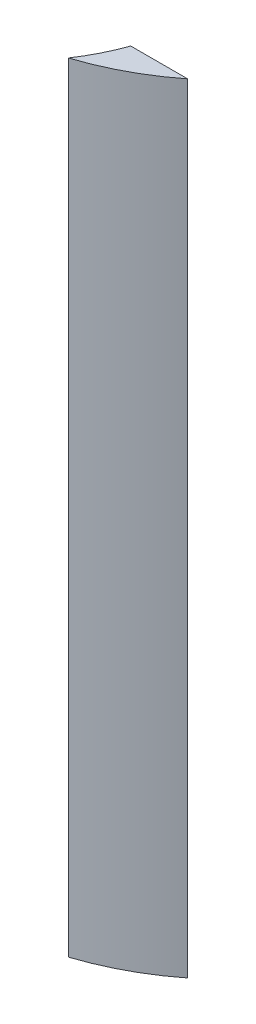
ISO-10303-21;
HEADER;
FILE_DESCRIPTION(('STEP AP214'),'2;1');
FILE_NAME('part.step','',(''),(''),'','','');
FILE_SCHEMA(('AUTOMOTIVE_DESIGN { 1 0 10303 214 1 1 1 1 }'));
ENDSEC;
DATA;
#1=APPLICATION_CONTEXT('core data for automotive mechanical design processes');
#2=APPLICATION_PROTOCOL_DEFINITION('international standard','automotive_design',2000,#1);
#3=PRODUCT_CONTEXT('',#1,'mechanical');
#4=PRODUCT('Part','Part','',(#3));
#5=PRODUCT_RELATED_PRODUCT_CATEGORY('part','',(#4));
#6=PRODUCT_DEFINITION_FORMATION('','',#4);
#7=PRODUCT_DEFINITION_CONTEXT('part definition',#1,'design');
#8=PRODUCT_DEFINITION('design','',#6,#7);
#9=PRODUCT_DEFINITION_SHAPE('','',#8);
#10=(LENGTH_UNIT() NAMED_UNIT(*) SI_UNIT(.MILLI.,.METRE.));
#11=(NAMED_UNIT(*) PLANE_ANGLE_UNIT() SI_UNIT($,.RADIAN.));
#12=(NAMED_UNIT(*) SI_UNIT($,.STERADIAN.) SOLID_ANGLE_UNIT());
#13=UNCERTAINTY_MEASURE_WITH_UNIT(LENGTH_MEASURE(1.E-05),#10,'distance_accuracy_value','');
#14=(GEOMETRIC_REPRESENTATION_CONTEXT(3) GLOBAL_UNCERTAINTY_ASSIGNED_CONTEXT((#13)) GLOBAL_UNIT_ASSIGNED_CONTEXT((#10,
#11,#12)) REPRESENTATION_CONTEXT('',''));
#15=CARTESIAN_POINT('',(0.,0.,0.));
#16=DIRECTION('',(0.,0.,1.));
#17=DIRECTION('',(1.,0.,0.));
#18=AXIS2_PLACEMENT_3D('',#15,#16,#17);
#19=CARTESIAN_POINT('',(0.,-300.,29.));
#20=DIRECTION('',(0.,1.,0.));
#21=DIRECTION('',(0.,0.,1.));
#22=AXIS2_PLACEMENT_3D('',#19,#20,#21);
#23=CYLINDRICAL_SURFACE('',#22,12.);
#24=CARTESIAN_POINT('',(0.,0.,29.));
#25=DIRECTION('',(0.,1.,0.));
#26=DIRECTION('',(0.,0.,1.));
#27=AXIS2_PLACEMENT_3D('',#24,#25,#26);
#28=CIRCLE('',#27,12.);
#29=CARTESIAN_POINT('',(9.97775303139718,0.,35.6666666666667));
#30=VERTEX_POINT('',#29);
#31=CARTESIAN_POINT('',(11.3137084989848,0.,33.));
#32=VERTEX_POINT('',#31);
#33=EDGE_CURVE('E83',#30,#32,#28,.T.);
#34=ORIENTED_EDGE('',*,*,#33,.F.);
#35=DIRECTION('',(0.,1.,0.));
#36=VECTOR('',#35,1.);
#37=CARTESIAN_POINT('',(9.97775303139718,0.,35.6666666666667));
#38=LINE('',#37,#36);
#39=CARTESIAN_POINT('',(9.97775303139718,50.,35.6666666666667));
#40=VERTEX_POINT('',#39);
#41=EDGE_CURVE('E54',#40,#30,#38,.F.);
#42=ORIENTED_EDGE('',*,*,#41,.F.);
#43=CARTESIAN_POINT('',(0.,50.,29.));
#44=DIRECTION('',(0.,1.,0.));
#45=DIRECTION('',(0.,0.,1.));
#46=AXIS2_PLACEMENT_3D('',#43,#44,#45);
#47=CIRCLE('',#46,12.);
#48=CARTESIAN_POINT('',(11.3137084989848,50.,33.));
#49=VERTEX_POINT('',#48);
#50=EDGE_CURVE('E100',#40,#49,#47,.T.);
#51=ORIENTED_EDGE('',*,*,#50,.T.);
#52=DIRECTION('',(0.,-1.,0.));
#53=VECTOR('',#52,1.);
#54=CARTESIAN_POINT('',(11.3137084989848,50.,33.));
#55=LINE('',#54,#53);
#56=EDGE_CURVE('E80',#32,#49,#55,.F.);
#57=ORIENTED_EDGE('',*,*,#56,.F.);
#58=EDGE_LOOP('',(#34,#42,#51,#57));
#59=FACE_BOUND('',#58,.T.);
#60=ADVANCED_FACE('F50',(#59),#23,.F.);
#61=CARTESIAN_POINT('',(4.98864452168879,50.0000000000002,20.332899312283));
#62=DIRECTION('',(0.,1.,0.));
#63=DIRECTION('',(0.,0.,1.));
#64=AXIS2_PLACEMENT_3D('',#61,#62,#63);
#65=PLANE('',#64);
#66=DIRECTION('',(1.,0.,0.));
#67=VECTOR('',#66,1.);
#68=CARTESIAN_POINT('',(-40.,50.,33.));
#69=LINE('',#68,#67);
#70=CARTESIAN_POINT('',(14.9666295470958,50.,33.));
#71=VERTEX_POINT('',#70);
#72=EDGE_CURVE('E99',#49,#71,#69,.T.);
#73=ORIENTED_EDGE('',*,*,#72,.F.);
#74=ORIENTED_EDGE('',*,*,#50,.F.);
#75=CARTESIAN_POINT('',(4.98864452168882,50.,20.3328993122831));
#76=DIRECTION('',(0.,1.,0.));
#77=DIRECTION('',(0.,0.,1.));
#78=AXIS2_PLACEMENT_3D('',#75,#76,#77);
#79=CIRCLE('',#78,16.1250000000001);
#80=EDGE_CURVE('E93',#71,#40,#79,.F.);
#81=ORIENTED_EDGE('',*,*,#80,.F.);
#82=EDGE_LOOP('',(#73,#74,#81));
#83=FACE_BOUND('',#82,.T.);
#84=ADVANCED_FACE('F116',(#83),#65,.T.);
#85=CARTESIAN_POINT('',(-40.,450.,33.));
#86=DIRECTION('',(0.,0.,-1.));
#87=DIRECTION('',(-1.,0.,0.));
#88=AXIS2_PLACEMENT_3D('',#85,#86,#87);
#89=PLANE('',#88);
#90=DIRECTION('',(0.,1.,0.));
#91=VECTOR('',#90,1.);
#92=CARTESIAN_POINT('',(14.9666295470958,0.,33.));
#93=LINE('',#92,#91);
#94=CARTESIAN_POINT('',(14.9666295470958,0.,33.));
#95=VERTEX_POINT('',#94);
#96=EDGE_CURVE('E60',#95,#71,#93,.T.);
#97=ORIENTED_EDGE('',*,*,#96,.F.);
#98=DIRECTION('',(1.,0.,0.));
#99=VECTOR('',#98,1.);
#100=CARTESIAN_POINT('',(-40.,0.,33.));
#101=LINE('',#100,#99);
#102=EDGE_CURVE('E87',#32,#95,#101,.T.);
#103=ORIENTED_EDGE('',*,*,#102,.F.);
#104=ORIENTED_EDGE('',*,*,#56,.T.);
#105=ORIENTED_EDGE('',*,*,#72,.T.);
#106=EDGE_LOOP('',(#97,#103,#104,#105));
#107=FACE_BOUND('',#106,.T.);
#108=ADVANCED_FACE('F114',(#107),#89,.T.);
#109=CARTESIAN_POINT('',(4.98864452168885,0.,20.3328993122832));
#110=DIRECTION('',(0.,1.,0.));
#111=DIRECTION('',(0.,0.,1.));
#112=AXIS2_PLACEMENT_3D('',#109,#110,#111);
#113=PLANE('',#112);
#114=ORIENTED_EDGE('',*,*,#102,.T.);
#115=CARTESIAN_POINT('',(4.98864452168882,0.,20.3328993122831));
#116=DIRECTION('',(0.,1.,0.));
#117=DIRECTION('',(0.,0.,1.));
#118=AXIS2_PLACEMENT_3D('',#115,#116,#117);
#119=CIRCLE('',#118,16.1250000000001);
#120=EDGE_CURVE('E12',#30,#95,#119,.T.);
#121=ORIENTED_EDGE('',*,*,#120,.F.);
#122=ORIENTED_EDGE('',*,*,#33,.T.);
#123=EDGE_LOOP('',(#114,#121,#122));
#124=FACE_BOUND('',#123,.T.);
#125=ADVANCED_FACE('F89',(#124),#113,.F.);
#126=CARTESIAN_POINT('',(4.98864452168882,0.,20.3328993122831));
#127=DIRECTION('',(0.,1.,0.));
#128=DIRECTION('',(0.,0.,1.));
#129=AXIS2_PLACEMENT_3D('',#126,#127,#128);
#130=CYLINDRICAL_SURFACE('',#129,16.1250000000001);
#131=ORIENTED_EDGE('',*,*,#120,.T.);
#132=ORIENTED_EDGE('',*,*,#96,.T.);
#133=ORIENTED_EDGE('',*,*,#80,.T.);
#134=ORIENTED_EDGE('',*,*,#41,.T.);
#135=EDGE_LOOP('',(#131,#132,#133,#134));
#136=FACE_BOUND('',#135,.T.);
#137=ADVANCED_FACE('F52',(#136),#130,.T.);
#138=CLOSED_SHELL('',(#60,#84,#108,#125,#137));
#139=MANIFOLD_SOLID_BREP('B2',#138);
#140=ADVANCED_BREP_SHAPE_REPRESENTATION('',(#18,#139),#14);
#141=SHAPE_DEFINITION_REPRESENTATION(#9,#140);
ENDSEC;
END-ISO-10303-21;
